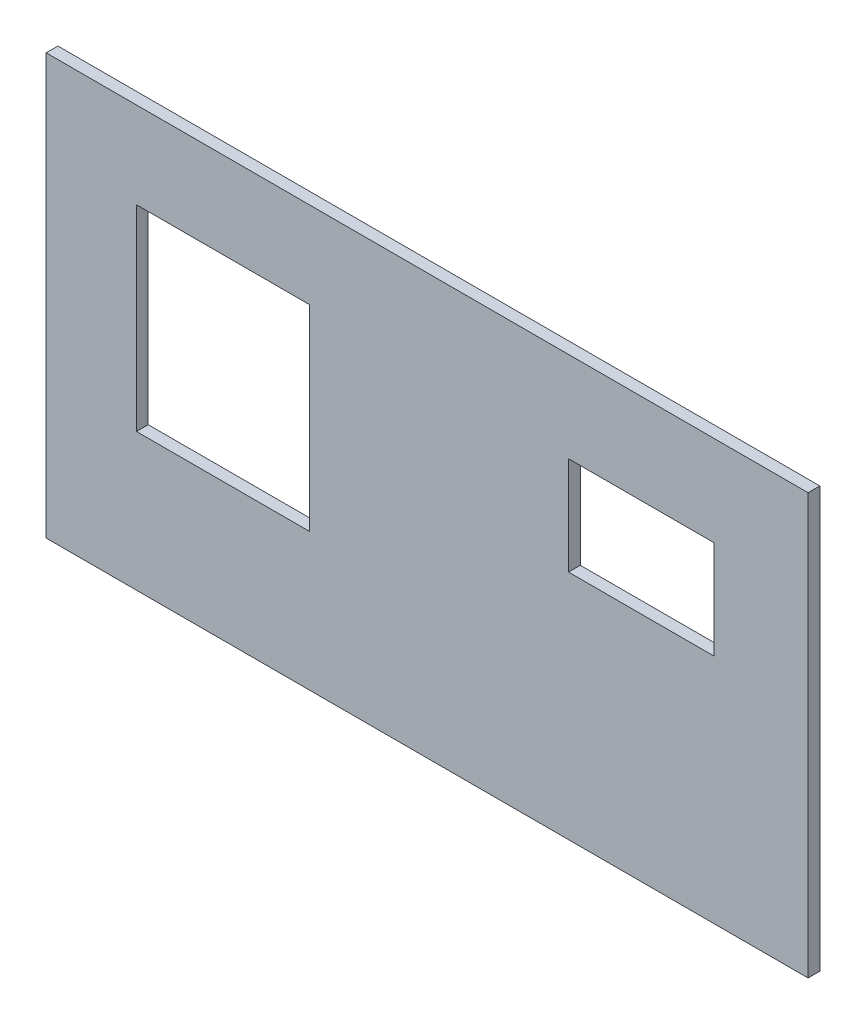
ISO-10303-21;
HEADER;
FILE_DESCRIPTION(('STEP AP214'),'2;1');
FILE_NAME('part.step','',(''),(''),'','','');
FILE_SCHEMA(('AUTOMOTIVE_DESIGN { 1 0 10303 214 1 1 1 1 }'));
ENDSEC;
DATA;
#1=APPLICATION_CONTEXT('core data for automotive mechanical design processes');
#2=APPLICATION_PROTOCOL_DEFINITION('international standard','automotive_design',2000,#1);
#3=PRODUCT_CONTEXT('',#1,'mechanical');
#4=PRODUCT('Part','Part','',(#3));
#5=PRODUCT_RELATED_PRODUCT_CATEGORY('part','',(#4));
#6=PRODUCT_DEFINITION_FORMATION('','',#4);
#7=PRODUCT_DEFINITION_CONTEXT('part definition',#1,'design');
#8=PRODUCT_DEFINITION('design','',#6,#7);
#9=PRODUCT_DEFINITION_SHAPE('','',#8);
#10=(LENGTH_UNIT() NAMED_UNIT(*) SI_UNIT(.MILLI.,.METRE.));
#11=(NAMED_UNIT(*) PLANE_ANGLE_UNIT() SI_UNIT($,.RADIAN.));
#12=(NAMED_UNIT(*) SI_UNIT($,.STERADIAN.) SOLID_ANGLE_UNIT());
#13=UNCERTAINTY_MEASURE_WITH_UNIT(LENGTH_MEASURE(1.E-05),#10,'distance_accuracy_value','');
#14=(GEOMETRIC_REPRESENTATION_CONTEXT(3) GLOBAL_UNCERTAINTY_ASSIGNED_CONTEXT((#13)) GLOBAL_UNIT_ASSIGNED_CONTEXT((#10,
#11,#12)) REPRESENTATION_CONTEXT('',''));
#15=CARTESIAN_POINT('',(0.,0.,0.));
#16=DIRECTION('',(0.,0.,1.));
#17=DIRECTION('',(1.,0.,0.));
#18=AXIS2_PLACEMENT_3D('',#15,#16,#17);
#19=CARTESIAN_POINT('',(0.,0.,3.));
#20=DIRECTION('',(1.,0.,0.));
#21=DIRECTION('',(0.,0.,-1.));
#22=AXIS2_PLACEMENT_3D('',#19,#20,#21);
#23=PLANE('',#22);
#24=DIRECTION('',(0.,-1.,0.));
#25=VECTOR('',#24,1.);
#26=CARTESIAN_POINT('',(0.,0.,0.));
#27=LINE('',#26,#25);
#28=CARTESIAN_POINT('',(0.,107.,0.));
#29=VERTEX_POINT('',#28);
#30=CARTESIAN_POINT('',(0.,0.,0.));
#31=VERTEX_POINT('',#30);
#32=EDGE_CURVE('E181',#29,#31,#27,.T.);
#33=ORIENTED_EDGE('',*,*,#32,.T.);
#34=DIRECTION('',(0.,0.,-1.));
#35=VECTOR('',#34,1.);
#36=CARTESIAN_POINT('',(0.,0.,3.));
#37=LINE('',#36,#35);
#38=CARTESIAN_POINT('',(0.,0.,3.));
#39=VERTEX_POINT('',#38);
#40=EDGE_CURVE('E11',#39,#31,#37,.T.);
#41=ORIENTED_EDGE('',*,*,#40,.F.);
#42=DIRECTION('',(0.,-1.,0.));
#43=VECTOR('',#42,1.);
#44=CARTESIAN_POINT('',(0.,0.,3.));
#45=LINE('',#44,#43);
#46=CARTESIAN_POINT('',(0.,107.,3.));
#47=VERTEX_POINT('',#46);
#48=EDGE_CURVE('E188',#47,#39,#45,.T.);
#49=ORIENTED_EDGE('',*,*,#48,.F.);
#50=DIRECTION('',(0.,0.,-1.));
#51=VECTOR('',#50,1.);
#52=CARTESIAN_POINT('',(0.,107.,3.));
#53=LINE('',#52,#51);
#54=EDGE_CURVE('E198',#47,#29,#53,.T.);
#55=ORIENTED_EDGE('',*,*,#54,.T.);
#56=EDGE_LOOP('',(#33,#41,#49,#55));
#57=FACE_BOUND('',#56,.T.);
#58=ADVANCED_FACE('F31',(#57),#23,.F.);
#59=CARTESIAN_POINT('',(0.,0.,3.));
#60=DIRECTION('',(0.,1.,0.));
#61=DIRECTION('',(0.,0.,1.));
#62=AXIS2_PLACEMENT_3D('',#59,#60,#61);
#63=PLANE('',#62);
#64=DIRECTION('',(1.,0.,0.));
#65=VECTOR('',#64,1.);
#66=CARTESIAN_POINT('',(0.,0.,0.));
#67=LINE('',#66,#65);
#68=CARTESIAN_POINT('',(194.,0.,0.));
#69=VERTEX_POINT('',#68);
#70=EDGE_CURVE('E201',#31,#69,#67,.T.);
#71=ORIENTED_EDGE('',*,*,#70,.T.);
#72=DIRECTION('',(0.,0.,-1.));
#73=VECTOR('',#72,1.);
#74=CARTESIAN_POINT('',(194.,0.,3.));
#75=LINE('',#74,#73);
#76=CARTESIAN_POINT('',(194.,0.,3.));
#77=VERTEX_POINT('',#76);
#78=EDGE_CURVE('E38',#77,#69,#75,.T.);
#79=ORIENTED_EDGE('',*,*,#78,.F.);
#80=DIRECTION('',(1.,0.,0.));
#81=VECTOR('',#80,1.);
#82=CARTESIAN_POINT('',(0.,0.,3.));
#83=LINE('',#82,#81);
#84=EDGE_CURVE('E191',#39,#77,#83,.T.);
#85=ORIENTED_EDGE('',*,*,#84,.F.);
#86=ORIENTED_EDGE('',*,*,#40,.T.);
#87=EDGE_LOOP('',(#71,#79,#85,#86));
#88=FACE_BOUND('',#87,.T.);
#89=ADVANCED_FACE('F230',(#88),#63,.F.);
#90=CARTESIAN_POINT('',(194.,0.,3.));
#91=DIRECTION('',(-1.,0.,0.));
#92=DIRECTION('',(0.,0.,1.));
#93=AXIS2_PLACEMENT_3D('',#90,#91,#92);
#94=PLANE('',#93);
#95=DIRECTION('',(0.,1.,0.));
#96=VECTOR('',#95,1.);
#97=CARTESIAN_POINT('',(194.,0.,0.));
#98=LINE('',#97,#96);
#99=CARTESIAN_POINT('',(194.,107.,0.));
#100=VERTEX_POINT('',#99);
#101=EDGE_CURVE('E203',#69,#100,#98,.T.);
#102=ORIENTED_EDGE('',*,*,#101,.T.);
#103=DIRECTION('',(0.,0.,-1.));
#104=VECTOR('',#103,1.);
#105=CARTESIAN_POINT('',(194.,107.,3.));
#106=LINE('',#105,#104);
#107=CARTESIAN_POINT('',(194.,107.,3.));
#108=VERTEX_POINT('',#107);
#109=EDGE_CURVE('E208',#108,#100,#106,.T.);
#110=ORIENTED_EDGE('',*,*,#109,.F.);
#111=DIRECTION('',(0.,1.,0.));
#112=VECTOR('',#111,1.);
#113=CARTESIAN_POINT('',(194.,0.,3.));
#114=LINE('',#113,#112);
#115=EDGE_CURVE('E194',#77,#108,#114,.T.);
#116=ORIENTED_EDGE('',*,*,#115,.F.);
#117=ORIENTED_EDGE('',*,*,#78,.T.);
#118=EDGE_LOOP('',(#102,#110,#116,#117));
#119=FACE_BOUND('',#118,.T.);
#120=ADVANCED_FACE('F215',(#119),#94,.F.);
#121=CARTESIAN_POINT('',(0.,107.,3.));
#122=DIRECTION('',(0.,-1.,0.));
#123=DIRECTION('',(0.,0.,-1.));
#124=AXIS2_PLACEMENT_3D('',#121,#122,#123);
#125=PLANE('',#124);
#126=DIRECTION('',(-1.,0.,0.));
#127=VECTOR('',#126,1.);
#128=CARTESIAN_POINT('',(0.,107.,0.));
#129=LINE('',#128,#127);
#130=EDGE_CURVE('E192',#100,#29,#129,.T.);
#131=ORIENTED_EDGE('',*,*,#130,.T.);
#132=ORIENTED_EDGE('',*,*,#54,.F.);
#133=DIRECTION('',(-1.,0.,0.));
#134=VECTOR('',#133,1.);
#135=CARTESIAN_POINT('',(0.,107.,3.));
#136=LINE('',#135,#134);
#137=EDGE_CURVE('E196',#108,#47,#136,.T.);
#138=ORIENTED_EDGE('',*,*,#137,.F.);
#139=ORIENTED_EDGE('',*,*,#109,.T.);
#140=EDGE_LOOP('',(#131,#132,#138,#139));
#141=FACE_BOUND('',#140,.T.);
#142=ADVANCED_FACE('F223',(#141),#125,.F.);
#143=CARTESIAN_POINT('',(0.,107.,3.));
#144=DIRECTION('',(0.,0.,-1.));
#145=DIRECTION('',(-1.,0.,0.));
#146=AXIS2_PLACEMENT_3D('',#143,#144,#145);
#147=PLANE('',#146);
#148=DIRECTION('',(1.,0.,0.));
#149=VECTOR('',#148,1.);
#150=CARTESIAN_POINT('',(133.,59.,3.));
#151=LINE('',#150,#149);
#152=CARTESIAN_POINT('',(133.,59.,3.));
#153=VERTEX_POINT('',#152);
#154=CARTESIAN_POINT('',(170.,59.,3.));
#155=VERTEX_POINT('',#154);
#156=EDGE_CURVE('E146',#153,#155,#151,.T.);
#157=ORIENTED_EDGE('',*,*,#156,.F.);
#158=DIRECTION('',(0.,-1.,0.));
#159=VECTOR('',#158,1.);
#160=CARTESIAN_POINT('',(133.,59.,3.));
#161=LINE('',#160,#159);
#162=CARTESIAN_POINT('',(133.,84.,3.));
#163=VERTEX_POINT('',#162);
#164=EDGE_CURVE('E45',#163,#153,#161,.T.);
#165=ORIENTED_EDGE('',*,*,#164,.F.);
#166=DIRECTION('',(-1.,0.,0.));
#167=VECTOR('',#166,1.);
#168=CARTESIAN_POINT('',(133.,84.,3.));
#169=LINE('',#168,#167);
#170=CARTESIAN_POINT('',(170.,84.,3.));
#171=VERTEX_POINT('',#170);
#172=EDGE_CURVE('E137',#171,#163,#169,.T.);
#173=ORIENTED_EDGE('',*,*,#172,.F.);
#174=DIRECTION('',(0.,1.,0.));
#175=VECTOR('',#174,1.);
#176=CARTESIAN_POINT('',(170.,59.,3.));
#177=LINE('',#176,#175);
#178=EDGE_CURVE('E140',#155,#171,#177,.T.);
#179=ORIENTED_EDGE('',*,*,#178,.F.);
#180=EDGE_LOOP('',(#157,#165,#173,#179));
#181=FACE_BOUND('',#180,.T.);
#182=DIRECTION('',(1.,0.,0.));
#183=VECTOR('',#182,1.);
#184=CARTESIAN_POINT('',(23.,35.,3.));
#185=LINE('',#184,#183);
#186=CARTESIAN_POINT('',(23.,35.,3.));
#187=VERTEX_POINT('',#186);
#188=CARTESIAN_POINT('',(67.,35.,3.));
#189=VERTEX_POINT('',#188);
#190=EDGE_CURVE('E171',#187,#189,#185,.T.);
#191=ORIENTED_EDGE('',*,*,#190,.F.);
#192=DIRECTION('',(0.,-1.,0.));
#193=VECTOR('',#192,1.);
#194=CARTESIAN_POINT('',(23.,35.,3.));
#195=LINE('',#194,#193);
#196=CARTESIAN_POINT('',(23.,85.,3.));
#197=VERTEX_POINT('',#196);
#198=EDGE_CURVE('E152',#197,#187,#195,.T.);
#199=ORIENTED_EDGE('',*,*,#198,.F.);
#200=DIRECTION('',(-1.,0.,0.));
#201=VECTOR('',#200,1.);
#202=CARTESIAN_POINT('',(23.,85.,3.));
#203=LINE('',#202,#201);
#204=CARTESIAN_POINT('',(67.,85.,3.));
#205=VERTEX_POINT('',#204);
#206=EDGE_CURVE('E160',#205,#197,#203,.T.);
#207=ORIENTED_EDGE('',*,*,#206,.F.);
#208=DIRECTION('',(0.,1.,0.));
#209=VECTOR('',#208,1.);
#210=CARTESIAN_POINT('',(67.,35.,3.));
#211=LINE('',#210,#209);
#212=EDGE_CURVE('E174',#189,#205,#211,.T.);
#213=ORIENTED_EDGE('',*,*,#212,.F.);
#214=EDGE_LOOP('',(#191,#199,#207,#213));
#215=FACE_BOUND('',#214,.T.);
#216=ORIENTED_EDGE('',*,*,#48,.T.);
#217=ORIENTED_EDGE('',*,*,#84,.T.);
#218=ORIENTED_EDGE('',*,*,#115,.T.);
#219=ORIENTED_EDGE('',*,*,#137,.T.);
#220=EDGE_LOOP('',(#216,#217,#218,#219));
#221=FACE_BOUND('',#220,.T.);
#222=ADVANCED_FACE('F229',(#181,#215,#221),#147,.F.);
#223=CARTESIAN_POINT('',(0.,107.,0.));
#224=DIRECTION('',(0.,0.,-1.));
#225=DIRECTION('',(-1.,0.,0.));
#226=AXIS2_PLACEMENT_3D('',#223,#224,#225);
#227=PLANE('',#226);
#228=DIRECTION('',(0.,-1.,0.));
#229=VECTOR('',#228,1.);
#230=CARTESIAN_POINT('',(133.,59.,0.));
#231=LINE('',#230,#229);
#232=CARTESIAN_POINT('',(133.,84.,0.));
#233=VERTEX_POINT('',#232);
#234=CARTESIAN_POINT('',(133.,59.,0.));
#235=VERTEX_POINT('',#234);
#236=EDGE_CURVE('E121',#233,#235,#231,.T.);
#237=ORIENTED_EDGE('',*,*,#236,.T.);
#238=DIRECTION('',(1.,0.,0.));
#239=VECTOR('',#238,1.);
#240=CARTESIAN_POINT('',(133.,59.,0.));
#241=LINE('',#240,#239);
#242=CARTESIAN_POINT('',(170.,59.,0.));
#243=VERTEX_POINT('',#242);
#244=EDGE_CURVE('E130',#235,#243,#241,.T.);
#245=ORIENTED_EDGE('',*,*,#244,.T.);
#246=DIRECTION('',(0.,1.,0.));
#247=VECTOR('',#246,1.);
#248=CARTESIAN_POINT('',(170.,59.,0.));
#249=LINE('',#248,#247);
#250=CARTESIAN_POINT('',(170.,84.,0.));
#251=VERTEX_POINT('',#250);
#252=EDGE_CURVE('E53',#243,#251,#249,.T.);
#253=ORIENTED_EDGE('',*,*,#252,.T.);
#254=DIRECTION('',(-1.,0.,0.));
#255=VECTOR('',#254,1.);
#256=CARTESIAN_POINT('',(133.,84.,0.));
#257=LINE('',#256,#255);
#258=EDGE_CURVE('E127',#251,#233,#257,.T.);
#259=ORIENTED_EDGE('',*,*,#258,.T.);
#260=EDGE_LOOP('',(#237,#245,#253,#259));
#261=FACE_BOUND('',#260,.T.);
#262=DIRECTION('',(0.,-1.,0.));
#263=VECTOR('',#262,1.);
#264=CARTESIAN_POINT('',(23.,35.,0.));
#265=LINE('',#264,#263);
#266=CARTESIAN_POINT('',(23.,85.,0.));
#267=VERTEX_POINT('',#266);
#268=CARTESIAN_POINT('',(23.,35.,0.));
#269=VERTEX_POINT('',#268);
#270=EDGE_CURVE('E156',#267,#269,#265,.T.);
#271=ORIENTED_EDGE('',*,*,#270,.T.);
#272=DIRECTION('',(1.,0.,0.));
#273=VECTOR('',#272,1.);
#274=CARTESIAN_POINT('',(23.,35.,0.));
#275=LINE('',#274,#273);
#276=CARTESIAN_POINT('',(67.,35.,0.));
#277=VERTEX_POINT('',#276);
#278=EDGE_CURVE('E159',#269,#277,#275,.T.);
#279=ORIENTED_EDGE('',*,*,#278,.T.);
#280=DIRECTION('',(0.,1.,0.));
#281=VECTOR('',#280,1.);
#282=CARTESIAN_POINT('',(67.,35.,0.));
#283=LINE('',#282,#281);
#284=CARTESIAN_POINT('',(67.,85.,0.));
#285=VERTEX_POINT('',#284);
#286=EDGE_CURVE('E163',#277,#285,#283,.T.);
#287=ORIENTED_EDGE('',*,*,#286,.T.);
#288=DIRECTION('',(-1.,0.,0.));
#289=VECTOR('',#288,1.);
#290=CARTESIAN_POINT('',(23.,85.,0.));
#291=LINE('',#290,#289);
#292=EDGE_CURVE('E166',#285,#267,#291,.T.);
#293=ORIENTED_EDGE('',*,*,#292,.T.);
#294=EDGE_LOOP('',(#271,#279,#287,#293));
#295=FACE_BOUND('',#294,.T.);
#296=ORIENTED_EDGE('',*,*,#32,.F.);
#297=ORIENTED_EDGE('',*,*,#130,.F.);
#298=ORIENTED_EDGE('',*,*,#101,.F.);
#299=ORIENTED_EDGE('',*,*,#70,.F.);
#300=EDGE_LOOP('',(#296,#297,#298,#299));
#301=FACE_BOUND('',#300,.T.);
#302=ADVANCED_FACE('F134',(#261,#295,#301),#227,.T.);
#303=CARTESIAN_POINT('',(23.,35.,0.));
#304=DIRECTION('',(-1.,0.,0.));
#305=DIRECTION('',(0.,0.,1.));
#306=AXIS2_PLACEMENT_3D('',#303,#304,#305);
#307=PLANE('',#306);
#308=ORIENTED_EDGE('',*,*,#198,.T.);
#309=DIRECTION('',(0.,0.,1.));
#310=VECTOR('',#309,1.);
#311=CARTESIAN_POINT('',(23.,35.,0.));
#312=LINE('',#311,#310);
#313=EDGE_CURVE('E169',#269,#187,#312,.T.);
#314=ORIENTED_EDGE('',*,*,#313,.F.);
#315=ORIENTED_EDGE('',*,*,#270,.F.);
#316=DIRECTION('',(0.,0.,1.));
#317=VECTOR('',#316,1.);
#318=CARTESIAN_POINT('',(23.,85.,0.));
#319=LINE('',#318,#317);
#320=EDGE_CURVE('E179',#267,#197,#319,.T.);
#321=ORIENTED_EDGE('',*,*,#320,.T.);
#322=EDGE_LOOP('',(#308,#314,#315,#321));
#323=FACE_BOUND('',#322,.T.);
#324=ADVANCED_FACE('F242',(#323),#307,.F.);
#325=CARTESIAN_POINT('',(23.,85.,0.));
#326=DIRECTION('',(0.,1.,0.));
#327=DIRECTION('',(0.,0.,1.));
#328=AXIS2_PLACEMENT_3D('',#325,#326,#327);
#329=PLANE('',#328);
#330=ORIENTED_EDGE('',*,*,#206,.T.);
#331=ORIENTED_EDGE('',*,*,#320,.F.);
#332=ORIENTED_EDGE('',*,*,#292,.F.);
#333=DIRECTION('',(0.,0.,1.));
#334=VECTOR('',#333,1.);
#335=CARTESIAN_POINT('',(67.,85.,0.));
#336=LINE('',#335,#334);
#337=EDGE_CURVE('E182',#285,#205,#336,.T.);
#338=ORIENTED_EDGE('',*,*,#337,.T.);
#339=EDGE_LOOP('',(#330,#331,#332,#338));
#340=FACE_BOUND('',#339,.T.);
#341=ADVANCED_FACE('F248',(#340),#329,.F.);
#342=CARTESIAN_POINT('',(67.,35.,0.));
#343=DIRECTION('',(1.,0.,0.));
#344=DIRECTION('',(0.,0.,-1.));
#345=AXIS2_PLACEMENT_3D('',#342,#343,#344);
#346=PLANE('',#345);
#347=ORIENTED_EDGE('',*,*,#212,.T.);
#348=ORIENTED_EDGE('',*,*,#337,.F.);
#349=ORIENTED_EDGE('',*,*,#286,.F.);
#350=DIRECTION('',(0.,0.,1.));
#351=VECTOR('',#350,1.);
#352=CARTESIAN_POINT('',(67.,35.,0.));
#353=LINE('',#352,#351);
#354=EDGE_CURVE('E184',#277,#189,#353,.T.);
#355=ORIENTED_EDGE('',*,*,#354,.T.);
#356=EDGE_LOOP('',(#347,#348,#349,#355));
#357=FACE_BOUND('',#356,.T.);
#358=ADVANCED_FACE('F253',(#357),#346,.F.);
#359=CARTESIAN_POINT('',(23.,35.,0.));
#360=DIRECTION('',(0.,-1.,0.));
#361=DIRECTION('',(0.,0.,-1.));
#362=AXIS2_PLACEMENT_3D('',#359,#360,#361);
#363=PLANE('',#362);
#364=ORIENTED_EDGE('',*,*,#190,.T.);
#365=ORIENTED_EDGE('',*,*,#354,.F.);
#366=ORIENTED_EDGE('',*,*,#278,.F.);
#367=ORIENTED_EDGE('',*,*,#313,.T.);
#368=EDGE_LOOP('',(#364,#365,#366,#367));
#369=FACE_BOUND('',#368,.T.);
#370=ADVANCED_FACE('F250',(#369),#363,.F.);
#371=CARTESIAN_POINT('',(133.,59.,0.));
#372=DIRECTION('',(-1.,0.,0.));
#373=DIRECTION('',(0.,0.,1.));
#374=AXIS2_PLACEMENT_3D('',#371,#372,#373);
#375=PLANE('',#374);
#376=ORIENTED_EDGE('',*,*,#164,.T.);
#377=DIRECTION('',(0.,0.,1.));
#378=VECTOR('',#377,1.);
#379=CARTESIAN_POINT('',(133.,59.,0.));
#380=LINE('',#379,#378);
#381=EDGE_CURVE('E117',#235,#153,#380,.T.);
#382=ORIENTED_EDGE('',*,*,#381,.F.);
#383=ORIENTED_EDGE('',*,*,#236,.F.);
#384=DIRECTION('',(0.,0.,1.));
#385=VECTOR('',#384,1.);
#386=CARTESIAN_POINT('',(133.,84.,0.));
#387=LINE('',#386,#385);
#388=EDGE_CURVE('E150',#233,#163,#387,.T.);
#389=ORIENTED_EDGE('',*,*,#388,.T.);
#390=EDGE_LOOP('',(#376,#382,#383,#389));
#391=FACE_BOUND('',#390,.T.);
#392=ADVANCED_FACE('F119',(#391),#375,.F.);
#393=CARTESIAN_POINT('',(133.,84.,0.));
#394=DIRECTION('',(0.,1.,0.));
#395=DIRECTION('',(0.,0.,1.));
#396=AXIS2_PLACEMENT_3D('',#393,#394,#395);
#397=PLANE('',#396);
#398=ORIENTED_EDGE('',*,*,#172,.T.);
#399=ORIENTED_EDGE('',*,*,#388,.F.);
#400=ORIENTED_EDGE('',*,*,#258,.F.);
#401=DIRECTION('',(0.,0.,1.));
#402=VECTOR('',#401,1.);
#403=CARTESIAN_POINT('',(170.,84.,0.));
#404=LINE('',#403,#402);
#405=EDGE_CURVE('E153',#251,#171,#404,.T.);
#406=ORIENTED_EDGE('',*,*,#405,.T.);
#407=EDGE_LOOP('',(#398,#399,#400,#406));
#408=FACE_BOUND('',#407,.T.);
#409=ADVANCED_FACE('F263',(#408),#397,.F.);
#410=CARTESIAN_POINT('',(170.,59.,0.));
#411=DIRECTION('',(1.,0.,0.));
#412=DIRECTION('',(0.,0.,-1.));
#413=AXIS2_PLACEMENT_3D('',#410,#411,#412);
#414=PLANE('',#413);
#415=ORIENTED_EDGE('',*,*,#178,.T.);
#416=ORIENTED_EDGE('',*,*,#405,.F.);
#417=ORIENTED_EDGE('',*,*,#252,.F.);
#418=DIRECTION('',(0.,0.,1.));
#419=VECTOR('',#418,1.);
#420=CARTESIAN_POINT('',(170.,59.,0.));
#421=LINE('',#420,#419);
#422=EDGE_CURVE('E126',#243,#155,#421,.T.);
#423=ORIENTED_EDGE('',*,*,#422,.T.);
#424=EDGE_LOOP('',(#415,#416,#417,#423));
#425=FACE_BOUND('',#424,.T.);
#426=ADVANCED_FACE('F266',(#425),#414,.F.);
#427=CARTESIAN_POINT('',(133.,59.,0.));
#428=DIRECTION('',(0.,-1.,0.));
#429=DIRECTION('',(0.,0.,-1.));
#430=AXIS2_PLACEMENT_3D('',#427,#428,#429);
#431=PLANE('',#430);
#432=ORIENTED_EDGE('',*,*,#156,.T.);
#433=ORIENTED_EDGE('',*,*,#422,.F.);
#434=ORIENTED_EDGE('',*,*,#244,.F.);
#435=ORIENTED_EDGE('',*,*,#381,.T.);
#436=EDGE_LOOP('',(#432,#433,#434,#435));
#437=FACE_BOUND('',#436,.T.);
#438=ADVANCED_FACE('F131',(#437),#431,.F.);
#439=CLOSED_SHELL('',(#58,#89,#120,#142,#222,#302,#324,#341,#358,#370,#392,#409,#426,#438));
#440=MANIFOLD_SOLID_BREP('B2',#439);
#441=ADVANCED_BREP_SHAPE_REPRESENTATION('',(#18,#440),#14);
#442=SHAPE_DEFINITION_REPRESENTATION(#9,#441);
ENDSEC;
END-ISO-10303-21;
